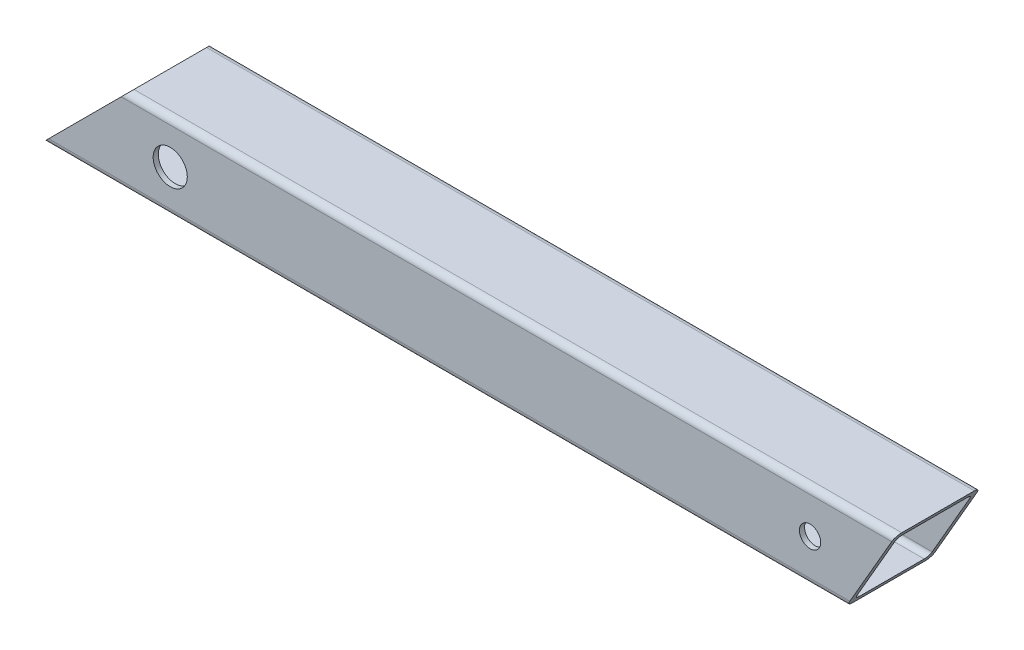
ISO-10303-21;
HEADER;
FILE_DESCRIPTION(('STEP AP214'),'2;1');
FILE_NAME('part.step','',(''),(''),'','','');
FILE_SCHEMA(('AUTOMOTIVE_DESIGN { 1 0 10303 214 1 1 1 1 }'));
ENDSEC;
DATA;
#1=APPLICATION_CONTEXT('core data for automotive mechanical design processes');
#2=APPLICATION_PROTOCOL_DEFINITION('international standard','automotive_design',2000,#1);
#3=PRODUCT_CONTEXT('',#1,'mechanical');
#4=PRODUCT('Part','Part','',(#3));
#5=PRODUCT_RELATED_PRODUCT_CATEGORY('part','',(#4));
#6=PRODUCT_DEFINITION_FORMATION('','',#4);
#7=PRODUCT_DEFINITION_CONTEXT('part definition',#1,'design');
#8=PRODUCT_DEFINITION('design','',#6,#7);
#9=PRODUCT_DEFINITION_SHAPE('','',#8);
#10=(LENGTH_UNIT() NAMED_UNIT(*) SI_UNIT(.MILLI.,.METRE.));
#11=(NAMED_UNIT(*) PLANE_ANGLE_UNIT() SI_UNIT($,.RADIAN.));
#12=(NAMED_UNIT(*) SI_UNIT($,.STERADIAN.) SOLID_ANGLE_UNIT());
#13=UNCERTAINTY_MEASURE_WITH_UNIT(LENGTH_MEASURE(1.E-05),#10,'distance_accuracy_value','');
#14=(GEOMETRIC_REPRESENTATION_CONTEXT(3) GLOBAL_UNCERTAINTY_ASSIGNED_CONTEXT((#13)) GLOBAL_UNIT_ASSIGNED_CONTEXT((#10,
#11,#12)) REPRESENTATION_CONTEXT('',''));
#15=CARTESIAN_POINT('',(0.,0.,0.));
#16=DIRECTION('',(0.,0.,1.));
#17=DIRECTION('',(1.,0.,0.));
#18=AXIS2_PLACEMENT_3D('',#15,#16,#17);
#19=CARTESIAN_POINT('',(1000.,38.,-38.0000000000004));
#20=DIRECTION('',(-1.,0.,0.));
#21=DIRECTION('',(0.,0.,1.));
#22=AXIS2_PLACEMENT_3D('',#19,#20,#21);
#23=CYLINDRICAL_SURFACE('',#22,5.99999999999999);
#24=DIRECTION('',(-1.,0.,0.));
#25=VECTOR('',#24,1.);
#26=CARTESIAN_POINT('',(1000.,38.,-44.0000000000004));
#27=LINE('',#26,#25);
#28=CARTESIAN_POINT('',(993.071796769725,38.,-44.0000000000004));
#29=VERTEX_POINT('',#28);
#30=CARTESIAN_POINT('',(87.9999999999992,38.,-44.));
#31=VERTEX_POINT('',#30);
#32=EDGE_CURVE('E12',#29,#31,#27,.T.);
#33=ORIENTED_EDGE('',*,*,#32,.F.);
#34=CARTESIAN_POINT('',(993.071796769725,38.,-38.0000000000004));
#35=DIRECTION('',(0.866025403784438,-0.500000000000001,0.));
#36=DIRECTION('',(-0.500000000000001,-0.866025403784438,0.));
#37=AXIS2_PLACEMENT_3D('',#34,#35,#36);
#38=ELLIPSE('',#37,6.9282032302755,5.99999999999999);
#39=CARTESIAN_POINT('',(996.535898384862,44.,-38.0000000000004));
#40=VERTEX_POINT('',#39);
#41=EDGE_CURVE('E287',#29,#40,#38,.T.);
#42=ORIENTED_EDGE('',*,*,#41,.T.);
#43=DIRECTION('',(-1.,0.,0.));
#44=VECTOR('',#43,1.);
#45=CARTESIAN_POINT('',(1000.,44.,-38.0000000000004));
#46=LINE('',#45,#44);
#47=CARTESIAN_POINT('',(93.9999999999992,44.,-38.));
#48=VERTEX_POINT('',#47);
#49=EDGE_CURVE('E213',#40,#48,#46,.T.);
#50=ORIENTED_EDGE('',*,*,#49,.T.);
#51=CARTESIAN_POINT('',(87.9999999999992,38.,-38.));
#52=DIRECTION('',(-0.707106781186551,0.707106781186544,0.));
#53=DIRECTION('',(-0.707106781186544,-0.707106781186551,0.));
#54=AXIS2_PLACEMENT_3D('',#51,#52,#53);
#55=ELLIPSE('',#54,8.48528137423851,5.99999999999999);
#56=EDGE_CURVE('E254',#48,#31,#55,.T.);
#57=ORIENTED_EDGE('',*,*,#56,.T.);
#58=EDGE_LOOP('',(#33,#42,#50,#57));
#59=FACE_BOUND('',#58,.T.);
#60=ADVANCED_FACE('F67',(#59),#23,.F.);
#61=CARTESIAN_POINT('',(1000.,38.,-44.0000000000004));
#62=DIRECTION('',(0.,0.,1.));
#63=DIRECTION('',(1.,0.,0.));
#64=AXIS2_PLACEMENT_3D('',#61,#62,#63);
#65=PLANE('',#64);
#66=CARTESIAN_POINT('',(900.,0.,-44.0000000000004));
#67=DIRECTION('',(0.,0.,1.));
#68=DIRECTION('',(1.,0.,0.));
#69=AXIS2_PLACEMENT_3D('',#66,#67,#68);
#70=CIRCLE('',#69,12.5);
#71=CARTESIAN_POINT('',(912.5,0.,-44.0000000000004));
#72=VERTEX_POINT('',#71);
#73=EDGE_CURVE('E324',#72,#72,#70,.T.);
#74=ORIENTED_EDGE('',*,*,#73,.F.);
#75=EDGE_LOOP('',(#74));
#76=FACE_BOUND('',#75,.T.);
#77=CARTESIAN_POINT('',(150.,0.,-44.0000000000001));
#78=DIRECTION('',(0.,0.,1.));
#79=DIRECTION('',(1.,0.,0.));
#80=AXIS2_PLACEMENT_3D('',#77,#78,#79);
#81=CIRCLE('',#80,20.);
#82=CARTESIAN_POINT('',(170.,0.,-44.0000000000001));
#83=VERTEX_POINT('',#82);
#84=EDGE_CURVE('E314',#83,#83,#81,.T.);
#85=ORIENTED_EDGE('',*,*,#84,.F.);
#86=EDGE_LOOP('',(#85));
#87=FACE_BOUND('',#86,.T.);
#88=DIRECTION('',(-1.,0.,0.));
#89=VECTOR('',#88,1.);
#90=CARTESIAN_POINT('',(1000.,-38.,-44.0000000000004));
#91=LINE('',#90,#89);
#92=CARTESIAN_POINT('',(949.193176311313,-38.,-44.0000000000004));
#93=VERTEX_POINT('',#92);
#94=CARTESIAN_POINT('',(12.,-38.,-44.));
#95=VERTEX_POINT('',#94);
#96=EDGE_CURVE('E76',#93,#95,#91,.T.);
#97=ORIENTED_EDGE('',*,*,#96,.F.);
#98=DIRECTION('',(0.500000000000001,0.866025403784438,0.));
#99=VECTOR('',#98,1.);
#100=CARTESIAN_POINT('',(994.803847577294,41.,-44.0000000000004));
#101=LINE('',#100,#99);
#102=EDGE_CURVE('E290',#93,#29,#101,.T.);
#103=ORIENTED_EDGE('',*,*,#102,.T.);
#104=ORIENTED_EDGE('',*,*,#32,.T.);
#105=DIRECTION('',(-0.707106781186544,-0.707106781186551,0.));
#106=VECTOR('',#105,1.);
#107=CARTESIAN_POINT('',(543.999999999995,494.000000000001,-44.0000000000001));
#108=LINE('',#107,#106);
#109=EDGE_CURVE('E257',#31,#95,#108,.T.);
#110=ORIENTED_EDGE('',*,*,#109,.T.);
#111=EDGE_LOOP('',(#97,#103,#104,#110));
#112=FACE_BOUND('',#111,.T.);
#113=ADVANCED_FACE('F357',(#76,#87,#112),#65,.T.);
#114=CARTESIAN_POINT('',(1000.,-38.,-38.0000000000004));
#115=DIRECTION('',(-1.,0.,0.));
#116=DIRECTION('',(0.,0.,1.));
#117=AXIS2_PLACEMENT_3D('',#114,#115,#116);
#118=CYLINDRICAL_SURFACE('',#117,5.99999999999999);
#119=DIRECTION('',(-1.,0.,0.));
#120=VECTOR('',#119,1.);
#121=CARTESIAN_POINT('',(1000.,-44.,-38.0000000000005));
#122=LINE('',#121,#120);
#123=CARTESIAN_POINT('',(945.729074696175,-44.,-38.0000000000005));
#124=VERTEX_POINT('',#123);
#125=CARTESIAN_POINT('',(5.9999999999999,-44.,-38.0000000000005));
#126=VERTEX_POINT('',#125);
#127=EDGE_CURVE('E223',#124,#126,#122,.T.);
#128=ORIENTED_EDGE('',*,*,#127,.F.);
#129=CARTESIAN_POINT('',(949.193176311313,-38.,-38.0000000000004));
#130=DIRECTION('',(0.866025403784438,-0.500000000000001,0.));
#131=DIRECTION('',(-0.500000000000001,-0.866025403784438,0.));
#132=AXIS2_PLACEMENT_3D('',#129,#130,#131);
#133=ELLIPSE('',#132,6.9282032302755,5.99999999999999);
#134=EDGE_CURVE('E293',#124,#93,#133,.T.);
#135=ORIENTED_EDGE('',*,*,#134,.T.);
#136=ORIENTED_EDGE('',*,*,#96,.T.);
#137=CARTESIAN_POINT('',(12.,-38.,-38.));
#138=DIRECTION('',(-0.707106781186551,0.707106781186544,0.));
#139=DIRECTION('',(-0.707106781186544,-0.707106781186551,0.));
#140=AXIS2_PLACEMENT_3D('',#137,#138,#139);
#141=ELLIPSE('',#140,8.48528137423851,5.99999999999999);
#142=EDGE_CURVE('E260',#95,#126,#141,.T.);
#143=ORIENTED_EDGE('',*,*,#142,.T.);
#144=EDGE_LOOP('',(#128,#135,#136,#143));
#145=FACE_BOUND('',#144,.T.);
#146=ADVANCED_FACE('F363',(#145),#118,.F.);
#147=CARTESIAN_POINT('',(1000.,-44.,37.9999999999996));
#148=DIRECTION('',(0.,1.,0.));
#149=DIRECTION('',(0.,0.,1.));
#150=AXIS2_PLACEMENT_3D('',#147,#148,#149);
#151=PLANE('',#150);
#152=DIRECTION('',(-1.,0.,0.));
#153=VECTOR('',#152,1.);
#154=CARTESIAN_POINT('',(1000.,-44.,37.9999999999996));
#155=LINE('',#154,#153);
#156=CARTESIAN_POINT('',(945.729074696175,-44.,37.9999999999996));
#157=VERTEX_POINT('',#156);
#158=CARTESIAN_POINT('',(6.00000000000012,-44.,38.));
#159=VERTEX_POINT('',#158);
#160=EDGE_CURVE('E221',#157,#159,#155,.T.);
#161=ORIENTED_EDGE('',*,*,#160,.F.);
#162=DIRECTION('',(0.,0.,-1.));
#163=VECTOR('',#162,1.);
#164=CARTESIAN_POINT('',(945.729074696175,-44.,37.9999999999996));
#165=LINE('',#164,#163);
#166=EDGE_CURVE('E296',#157,#124,#165,.T.);
#167=ORIENTED_EDGE('',*,*,#166,.T.);
#168=ORIENTED_EDGE('',*,*,#127,.T.);
#169=DIRECTION('',(0.,0.,1.));
#170=VECTOR('',#169,1.);
#171=CARTESIAN_POINT('',(5.99999999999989,-44.,37.9999999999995));
#172=LINE('',#171,#170);
#173=EDGE_CURVE('E263',#126,#159,#172,.T.);
#174=ORIENTED_EDGE('',*,*,#173,.T.);
#175=EDGE_LOOP('',(#161,#167,#168,#174));
#176=FACE_BOUND('',#175,.T.);
#177=ADVANCED_FACE('F414',(#176),#151,.T.);
#178=CARTESIAN_POINT('',(1000.,-38.,37.9999999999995));
#179=DIRECTION('',(-1.,0.,0.));
#180=DIRECTION('',(0.,0.,1.));
#181=AXIS2_PLACEMENT_3D('',#178,#179,#180);
#182=CYLINDRICAL_SURFACE('',#181,5.99999999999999);
#183=DIRECTION('',(-1.,0.,0.));
#184=VECTOR('',#183,1.);
#185=CARTESIAN_POINT('',(1000.,-38.,43.9999999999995));
#186=LINE('',#185,#184);
#187=CARTESIAN_POINT('',(949.193176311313,-38.,43.9999999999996));
#188=VERTEX_POINT('',#187);
#189=CARTESIAN_POINT('',(11.9999999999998,-38.0000000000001,44.));
#190=VERTEX_POINT('',#189);
#191=EDGE_CURVE('E219',#188,#190,#186,.T.);
#192=ORIENTED_EDGE('',*,*,#191,.F.);
#193=CARTESIAN_POINT('',(949.193176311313,-38.,37.9999999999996));
#194=DIRECTION('',(0.866025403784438,-0.500000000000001,0.));
#195=DIRECTION('',(-0.500000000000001,-0.866025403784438,0.));
#196=AXIS2_PLACEMENT_3D('',#193,#194,#195);
#197=ELLIPSE('',#196,6.9282032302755,5.99999999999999);
#198=EDGE_CURVE('E299',#188,#157,#197,.T.);
#199=ORIENTED_EDGE('',*,*,#198,.T.);
#200=ORIENTED_EDGE('',*,*,#160,.T.);
#201=CARTESIAN_POINT('',(12.,-38.,38.));
#202=DIRECTION('',(-0.707106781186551,0.707106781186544,0.));
#203=DIRECTION('',(-0.707106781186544,-0.707106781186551,0.));
#204=AXIS2_PLACEMENT_3D('',#201,#202,#203);
#205=ELLIPSE('',#204,8.48528137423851,5.99999999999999);
#206=EDGE_CURVE('E266',#159,#190,#205,.T.);
#207=ORIENTED_EDGE('',*,*,#206,.T.);
#208=EDGE_LOOP('',(#192,#199,#200,#207));
#209=FACE_BOUND('',#208,.T.);
#210=ADVANCED_FACE('F410',(#209),#182,.F.);
#211=CARTESIAN_POINT('',(1000.,38.,43.9999999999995));
#212=DIRECTION('',(0.,0.,-1.));
#213=DIRECTION('',(-1.,0.,0.));
#214=AXIS2_PLACEMENT_3D('',#211,#212,#213);
#215=PLANE('',#214);
#216=CARTESIAN_POINT('',(900.,0.,43.9999999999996));
#217=DIRECTION('',(0.,0.,-1.));
#218=DIRECTION('',(-1.,0.,0.));
#219=AXIS2_PLACEMENT_3D('',#216,#217,#218);
#220=CIRCLE('',#219,12.5);
#221=CARTESIAN_POINT('',(887.5,0.,43.9999999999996));
#222=VERTEX_POINT('',#221);
#223=EDGE_CURVE('E329',#222,#222,#220,.T.);
#224=ORIENTED_EDGE('',*,*,#223,.F.);
#225=EDGE_LOOP('',(#224));
#226=FACE_BOUND('',#225,.T.);
#227=CARTESIAN_POINT('',(150.,0.,43.9999999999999));
#228=DIRECTION('',(0.,0.,-1.));
#229=DIRECTION('',(-1.,0.,0.));
#230=AXIS2_PLACEMENT_3D('',#227,#228,#229);
#231=CIRCLE('',#230,20.);
#232=CARTESIAN_POINT('',(130.,0.,43.9999999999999));
#233=VERTEX_POINT('',#232);
#234=EDGE_CURVE('E317',#233,#233,#231,.T.);
#235=ORIENTED_EDGE('',*,*,#234,.F.);
#236=EDGE_LOOP('',(#235));
#237=FACE_BOUND('',#236,.T.);
#238=DIRECTION('',(-1.,0.,0.));
#239=VECTOR('',#238,1.);
#240=CARTESIAN_POINT('',(1000.,38.,43.9999999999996));
#241=LINE('',#240,#239);
#242=CARTESIAN_POINT('',(993.071796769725,38.,43.9999999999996));
#243=VERTEX_POINT('',#242);
#244=CARTESIAN_POINT('',(87.9999999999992,38.,44.));
#245=VERTEX_POINT('',#244);
#246=EDGE_CURVE('E217',#243,#245,#241,.T.);
#247=ORIENTED_EDGE('',*,*,#246,.F.);
#248=DIRECTION('',(-0.500000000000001,-0.866025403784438,0.));
#249=VECTOR('',#248,1.);
#250=CARTESIAN_POINT('',(994.803847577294,41.,43.9999999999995));
#251=LINE('',#250,#249);
#252=EDGE_CURVE('E302',#243,#188,#251,.T.);
#253=ORIENTED_EDGE('',*,*,#252,.T.);
#254=ORIENTED_EDGE('',*,*,#191,.T.);
#255=DIRECTION('',(0.707106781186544,0.707106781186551,0.));
#256=VECTOR('',#255,1.);
#257=CARTESIAN_POINT('',(543.999999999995,494.000000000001,43.9999999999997));
#258=LINE('',#257,#256);
#259=EDGE_CURVE('E269',#190,#245,#258,.T.);
#260=ORIENTED_EDGE('',*,*,#259,.T.);
#261=EDGE_LOOP('',(#247,#253,#254,#260));
#262=FACE_BOUND('',#261,.T.);
#263=ADVANCED_FACE('F406',(#226,#237,#262),#215,.T.);
#264=CARTESIAN_POINT('',(1000.,38.,37.9999999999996));
#265=DIRECTION('',(-1.,0.,0.));
#266=DIRECTION('',(0.,0.,1.));
#267=AXIS2_PLACEMENT_3D('',#264,#265,#266);
#268=CYLINDRICAL_SURFACE('',#267,5.99999999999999);
#269=DIRECTION('',(-1.,0.,0.));
#270=VECTOR('',#269,1.);
#271=CARTESIAN_POINT('',(1000.,44.,37.9999999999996));
#272=LINE('',#271,#270);
#273=CARTESIAN_POINT('',(996.535898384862,44.,37.9999999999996));
#274=VERTEX_POINT('',#273);
#275=CARTESIAN_POINT('',(93.9999999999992,44.,38.));
#276=VERTEX_POINT('',#275);
#277=EDGE_CURVE('E215',#274,#276,#272,.T.);
#278=ORIENTED_EDGE('',*,*,#277,.F.);
#279=CARTESIAN_POINT('',(993.071796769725,38.,37.9999999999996));
#280=DIRECTION('',(0.866025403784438,-0.500000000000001,0.));
#281=DIRECTION('',(-0.500000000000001,-0.866025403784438,0.));
#282=AXIS2_PLACEMENT_3D('',#279,#280,#281);
#283=ELLIPSE('',#282,6.9282032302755,5.99999999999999);
#284=EDGE_CURVE('E305',#274,#243,#283,.T.);
#285=ORIENTED_EDGE('',*,*,#284,.T.);
#286=ORIENTED_EDGE('',*,*,#246,.T.);
#287=CARTESIAN_POINT('',(87.9999999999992,38.,38.));
#288=DIRECTION('',(-0.707106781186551,0.707106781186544,0.));
#289=DIRECTION('',(-0.707106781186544,-0.707106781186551,0.));
#290=AXIS2_PLACEMENT_3D('',#287,#288,#289);
#291=ELLIPSE('',#290,8.48528137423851,5.99999999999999);
#292=EDGE_CURVE('E272',#245,#276,#291,.T.);
#293=ORIENTED_EDGE('',*,*,#292,.T.);
#294=EDGE_LOOP('',(#278,#285,#286,#293));
#295=FACE_BOUND('',#294,.T.);
#296=ADVANCED_FACE('F403',(#295),#268,.F.);
#297=CARTESIAN_POINT('',(1000.,42.5,-42.5000000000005));
#298=DIRECTION('',(-1.,0.,0.));
#299=DIRECTION('',(0.,0.,1.));
#300=AXIS2_PLACEMENT_3D('',#297,#298,#299);
#301=CYLINDRICAL_SURFACE('',#300,7.5);
#302=CARTESIAN_POINT('',(995.669872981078,42.5,-42.5000000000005));
#303=DIRECTION('',(0.866025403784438,-0.500000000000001,0.));
#304=DIRECTION('',(-0.500000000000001,-0.866025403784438,0.));
#305=AXIS2_PLACEMENT_3D('',#302,#303,#304);
#306=ELLIPSE('',#305,8.66025403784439,7.5);
#307=CARTESIAN_POINT('',(995.669872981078,42.5,-50.0000000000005));
#308=VERTEX_POINT('',#307);
#309=CARTESIAN_POINT('',(1000.,50.,-42.5000000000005));
#310=VERTEX_POINT('',#309);
#311=EDGE_CURVE('E201',#308,#310,#306,.T.);
#312=ORIENTED_EDGE('',*,*,#311,.F.);
#313=DIRECTION('',(-1.,0.,0.));
#314=VECTOR('',#313,1.);
#315=CARTESIAN_POINT('',(1000.,42.5,-50.0000000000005));
#316=LINE('',#315,#314);
#317=CARTESIAN_POINT('',(92.4999999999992,42.5000000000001,-50.0000000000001));
#318=VERTEX_POINT('',#317);
#319=EDGE_CURVE('E202',#308,#318,#316,.T.);
#320=ORIENTED_EDGE('',*,*,#319,.T.);
#321=CARTESIAN_POINT('',(92.4999999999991,42.5,-42.5));
#322=DIRECTION('',(-0.707106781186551,0.707106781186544,0.));
#323=DIRECTION('',(-0.707106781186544,-0.707106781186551,0.));
#324=AXIS2_PLACEMENT_3D('',#321,#322,#323);
#325=ELLIPSE('',#324,10.6066017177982,7.5);
#326=CARTESIAN_POINT('',(99.999999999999,50.,-42.5000000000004));
#327=VERTEX_POINT('',#326);
#328=EDGE_CURVE('E243',#327,#318,#325,.T.);
#329=ORIENTED_EDGE('',*,*,#328,.F.);
#330=DIRECTION('',(-1.,0.,0.));
#331=VECTOR('',#330,1.);
#332=CARTESIAN_POINT('',(1000.,50.,-42.5000000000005));
#333=LINE('',#332,#331);
#334=EDGE_CURVE('E71',#310,#327,#333,.T.);
#335=ORIENTED_EDGE('',*,*,#334,.F.);
#336=EDGE_LOOP('',(#312,#320,#329,#335));
#337=FACE_BOUND('',#336,.T.);
#338=ADVANCED_FACE('F69',(#337),#301,.T.);
#339=CARTESIAN_POINT('',(1000.,42.5,42.4999999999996));
#340=DIRECTION('',(-1.,0.,0.));
#341=DIRECTION('',(0.,0.,1.));
#342=AXIS2_PLACEMENT_3D('',#339,#340,#341);
#343=CYLINDRICAL_SURFACE('',#342,7.5);
#344=CARTESIAN_POINT('',(995.669872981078,42.5,42.4999999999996));
#345=DIRECTION('',(0.866025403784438,-0.500000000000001,0.));
#346=DIRECTION('',(-0.500000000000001,-0.866025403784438,0.));
#347=AXIS2_PLACEMENT_3D('',#344,#345,#346);
#348=ELLIPSE('',#347,8.66025403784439,7.5);
#349=CARTESIAN_POINT('',(1000.,50.,42.4999999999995));
#350=VERTEX_POINT('',#349);
#351=CARTESIAN_POINT('',(995.669872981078,42.5,49.9999999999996));
#352=VERTEX_POINT('',#351);
#353=EDGE_CURVE('E194',#350,#352,#348,.T.);
#354=ORIENTED_EDGE('',*,*,#353,.F.);
#355=DIRECTION('',(-1.,0.,0.));
#356=VECTOR('',#355,1.);
#357=CARTESIAN_POINT('',(1000.,50.,42.4999999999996));
#358=LINE('',#357,#356);
#359=CARTESIAN_POINT('',(99.9999999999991,50.,42.5));
#360=VERTEX_POINT('',#359);
#361=EDGE_CURVE('E182',#350,#360,#358,.T.);
#362=ORIENTED_EDGE('',*,*,#361,.T.);
#363=CARTESIAN_POINT('',(92.4999999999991,42.5,42.5));
#364=DIRECTION('',(-0.707106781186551,0.707106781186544,0.));
#365=DIRECTION('',(-0.707106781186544,-0.707106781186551,0.));
#366=AXIS2_PLACEMENT_3D('',#363,#364,#365);
#367=ELLIPSE('',#366,10.6066017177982,7.5);
#368=CARTESIAN_POINT('',(92.4999999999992,42.5000000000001,50.));
#369=VERTEX_POINT('',#368);
#370=EDGE_CURVE('E208',#369,#360,#367,.T.);
#371=ORIENTED_EDGE('',*,*,#370,.F.);
#372=DIRECTION('',(-1.,0.,0.));
#373=VECTOR('',#372,1.);
#374=CARTESIAN_POINT('',(1000.,42.5,49.9999999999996));
#375=LINE('',#374,#373);
#376=EDGE_CURVE('E192',#352,#369,#375,.T.);
#377=ORIENTED_EDGE('',*,*,#376,.F.);
#378=EDGE_LOOP('',(#354,#362,#371,#377));
#379=FACE_BOUND('',#378,.T.);
#380=ADVANCED_FACE('F195',(#379),#343,.T.);
#381=CARTESIAN_POINT('',(1000.,42.5,49.9999999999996));
#382=DIRECTION('',(0.,0.,-1.));
#383=DIRECTION('',(-1.,0.,0.));
#384=AXIS2_PLACEMENT_3D('',#381,#382,#383);
#385=PLANE('',#384);
#386=CARTESIAN_POINT('',(900.,0.,50.));
#387=DIRECTION('',(0.,0.,1.));
#388=DIRECTION('',(1.,0.,0.));
#389=AXIS2_PLACEMENT_3D('',#386,#387,#388);
#390=CIRCLE('',#389,12.5);
#391=CARTESIAN_POINT('',(912.5,0.,50.));
#392=VERTEX_POINT('',#391);
#393=EDGE_CURVE('E333',#392,#392,#390,.T.);
#394=ORIENTED_EDGE('',*,*,#393,.F.);
#395=EDGE_LOOP('',(#394));
#396=FACE_BOUND('',#395,.T.);
#397=CARTESIAN_POINT('',(150.,0.,50.));
#398=DIRECTION('',(0.,0.,1.));
#399=DIRECTION('',(1.,0.,0.));
#400=AXIS2_PLACEMENT_3D('',#397,#398,#399);
#401=CIRCLE('',#400,20.);
#402=CARTESIAN_POINT('',(170.,0.,50.));
#403=VERTEX_POINT('',#402);
#404=EDGE_CURVE('E321',#403,#403,#401,.T.);
#405=ORIENTED_EDGE('',*,*,#404,.F.);
#406=EDGE_LOOP('',(#405));
#407=FACE_BOUND('',#406,.T.);
#408=DIRECTION('',(-0.500000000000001,-0.866025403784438,0.));
#409=VECTOR('',#408,1.);
#410=CARTESIAN_POINT('',(996.752404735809,44.375,49.9999999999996));
#411=LINE('',#410,#409);
#412=CARTESIAN_POINT('',(946.59510009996,-42.5,49.9999999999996));
#413=VERTEX_POINT('',#412);
#414=EDGE_CURVE('E84',#352,#413,#411,.T.);
#415=ORIENTED_EDGE('',*,*,#414,.F.);
#416=ORIENTED_EDGE('',*,*,#376,.T.);
#417=DIRECTION('',(0.707106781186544,0.707106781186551,0.));
#418=VECTOR('',#417,1.);
#419=CARTESIAN_POINT('',(546.249999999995,496.250000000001,49.9999999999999));
#420=LINE('',#419,#418);
#421=CARTESIAN_POINT('',(7.49999999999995,-42.5,50.));
#422=VERTEX_POINT('',#421);
#423=EDGE_CURVE('E236',#422,#369,#420,.T.);
#424=ORIENTED_EDGE('',*,*,#423,.F.);
#425=DIRECTION('',(-1.,0.,0.));
#426=VECTOR('',#425,1.);
#427=CARTESIAN_POINT('',(1000.,-42.5,49.9999999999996));
#428=LINE('',#427,#426);
#429=EDGE_CURVE('E231',#413,#422,#428,.T.);
#430=ORIENTED_EDGE('',*,*,#429,.F.);
#431=EDGE_LOOP('',(#415,#416,#424,#430));
#432=FACE_BOUND('',#431,.T.);
#433=ADVANCED_FACE('F235',(#396,#407,#432),#385,.F.);
#434=CARTESIAN_POINT('',(1000.,-42.5,42.4999999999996));
#435=DIRECTION('',(-1.,0.,0.));
#436=DIRECTION('',(0.,0.,1.));
#437=AXIS2_PLACEMENT_3D('',#434,#435,#436);
#438=CYLINDRICAL_SURFACE('',#437,7.5);
#439=CARTESIAN_POINT('',(946.59510009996,-42.5,42.4999999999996));
#440=DIRECTION('',(0.866025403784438,-0.500000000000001,0.));
#441=DIRECTION('',(-0.500000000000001,-0.866025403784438,0.));
#442=AXIS2_PLACEMENT_3D('',#439,#440,#441);
#443=ELLIPSE('',#442,8.66025403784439,7.5);
#444=CARTESIAN_POINT('',(942.264973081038,-50.,42.4999999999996));
#445=VERTEX_POINT('',#444);
#446=EDGE_CURVE('E92',#413,#445,#443,.T.);
#447=ORIENTED_EDGE('',*,*,#446,.F.);
#448=ORIENTED_EDGE('',*,*,#429,.T.);
#449=CARTESIAN_POINT('',(7.49999999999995,-42.5,42.5));
#450=DIRECTION('',(-0.707106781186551,0.707106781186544,0.));
#451=DIRECTION('',(-0.707106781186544,-0.707106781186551,0.));
#452=AXIS2_PLACEMENT_3D('',#449,#450,#451);
#453=ELLIPSE('',#452,10.6066017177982,7.5);
#454=CARTESIAN_POINT('',(0.,-50.,42.5));
#455=VERTEX_POINT('',#454);
#456=EDGE_CURVE('E242',#455,#422,#453,.T.);
#457=ORIENTED_EDGE('',*,*,#456,.F.);
#458=DIRECTION('',(-1.,0.,0.));
#459=VECTOR('',#458,1.);
#460=CARTESIAN_POINT('',(1000.,-50.,42.4999999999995));
#461=LINE('',#460,#459);
#462=EDGE_CURVE('E229',#445,#455,#461,.T.);
#463=ORIENTED_EDGE('',*,*,#462,.F.);
#464=EDGE_LOOP('',(#447,#448,#457,#463));
#465=FACE_BOUND('',#464,.T.);
#466=ADVANCED_FACE('F375',(#465),#438,.T.);
#467=CARTESIAN_POINT('',(1000.,-42.5,-42.5000000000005));
#468=DIRECTION('',(-1.,0.,0.));
#469=DIRECTION('',(0.,0.,1.));
#470=AXIS2_PLACEMENT_3D('',#467,#468,#469);
#471=CYLINDRICAL_SURFACE('',#470,7.5);
#472=CARTESIAN_POINT('',(946.59510009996,-42.5,-42.5000000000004));
#473=DIRECTION('',(0.866025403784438,-0.500000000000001,0.));
#474=DIRECTION('',(-0.500000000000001,-0.866025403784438,0.));
#475=AXIS2_PLACEMENT_3D('',#472,#473,#474);
#476=ELLIPSE('',#475,8.66025403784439,7.5);
#477=CARTESIAN_POINT('',(942.264973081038,-50.,-42.5000000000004));
#478=VERTEX_POINT('',#477);
#479=CARTESIAN_POINT('',(946.59510009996,-42.5,-50.0000000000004));
#480=VERTEX_POINT('',#479);
#481=EDGE_CURVE('E282',#478,#480,#476,.T.);
#482=ORIENTED_EDGE('',*,*,#481,.F.);
#483=DIRECTION('',(-1.,0.,0.));
#484=VECTOR('',#483,1.);
#485=CARTESIAN_POINT('',(1000.,-50.,-42.5000000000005));
#486=LINE('',#485,#484);
#487=CARTESIAN_POINT('',(0.,-50.,-42.5));
#488=VERTEX_POINT('',#487);
#489=EDGE_CURVE('E227',#478,#488,#486,.T.);
#490=ORIENTED_EDGE('',*,*,#489,.T.);
#491=CARTESIAN_POINT('',(7.49999999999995,-42.5,-42.5));
#492=DIRECTION('',(-0.707106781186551,0.707106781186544,0.));
#493=DIRECTION('',(-0.707106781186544,-0.707106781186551,0.));
#494=AXIS2_PLACEMENT_3D('',#491,#492,#493);
#495=ELLIPSE('',#494,10.6066017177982,7.5);
#496=CARTESIAN_POINT('',(7.49999999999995,-42.5,-50.));
#497=VERTEX_POINT('',#496);
#498=EDGE_CURVE('E248',#497,#488,#495,.T.);
#499=ORIENTED_EDGE('',*,*,#498,.F.);
#500=DIRECTION('',(-1.,0.,0.));
#501=VECTOR('',#500,1.);
#502=CARTESIAN_POINT('',(1000.,-42.5,-50.0000000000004));
#503=LINE('',#502,#501);
#504=EDGE_CURVE('E205',#480,#497,#503,.T.);
#505=ORIENTED_EDGE('',*,*,#504,.F.);
#506=EDGE_LOOP('',(#482,#490,#499,#505));
#507=FACE_BOUND('',#506,.T.);
#508=ADVANCED_FACE('F372',(#507),#471,.T.);
#509=CARTESIAN_POINT('',(1000.,42.5,-50.0000000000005));
#510=DIRECTION('',(0.,0.,1.));
#511=DIRECTION('',(1.,0.,0.));
#512=AXIS2_PLACEMENT_3D('',#509,#510,#511);
#513=PLANE('',#512);
#514=CARTESIAN_POINT('',(900.,0.,-50.0000000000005));
#515=DIRECTION('',(0.,0.,1.));
#516=DIRECTION('',(1.,0.,0.));
#517=AXIS2_PLACEMENT_3D('',#514,#515,#516);
#518=CIRCLE('',#517,12.5);
#519=CARTESIAN_POINT('',(912.5,0.,-50.0000000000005));
#520=VERTEX_POINT('',#519);
#521=EDGE_CURVE('E332',#520,#520,#518,.T.);
#522=ORIENTED_EDGE('',*,*,#521,.T.);
#523=EDGE_LOOP('',(#522));
#524=FACE_BOUND('',#523,.T.);
#525=CARTESIAN_POINT('',(150.,0.,-50.0000000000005));
#526=DIRECTION('',(0.,0.,1.));
#527=DIRECTION('',(1.,0.,0.));
#528=AXIS2_PLACEMENT_3D('',#525,#526,#527);
#529=CIRCLE('',#528,20.);
#530=CARTESIAN_POINT('',(170.,0.,-50.0000000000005));
#531=VERTEX_POINT('',#530);
#532=EDGE_CURVE('E320',#531,#531,#529,.T.);
#533=ORIENTED_EDGE('',*,*,#532,.T.);
#534=EDGE_LOOP('',(#533));
#535=FACE_BOUND('',#534,.T.);
#536=DIRECTION('',(0.500000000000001,0.866025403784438,0.));
#537=VECTOR('',#536,1.);
#538=CARTESIAN_POINT('',(996.752404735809,44.375,-50.0000000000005));
#539=LINE('',#538,#537);
#540=EDGE_CURVE('E285',#480,#308,#539,.T.);
#541=ORIENTED_EDGE('',*,*,#540,.F.);
#542=ORIENTED_EDGE('',*,*,#504,.T.);
#543=DIRECTION('',(-0.707106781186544,-0.707106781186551,0.));
#544=VECTOR('',#543,1.);
#545=CARTESIAN_POINT('',(546.249999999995,496.250000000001,-50.0000000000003));
#546=LINE('',#545,#544);
#547=EDGE_CURVE('E251',#318,#497,#546,.T.);
#548=ORIENTED_EDGE('',*,*,#547,.F.);
#549=ORIENTED_EDGE('',*,*,#319,.F.);
#550=EDGE_LOOP('',(#541,#542,#548,#549));
#551=FACE_BOUND('',#550,.T.);
#552=ADVANCED_FACE('F339',(#524,#535,#551),#513,.F.);
#553=CARTESIAN_POINT('',(1000.,44.,37.9999999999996));
#554=DIRECTION('',(0.,-1.,0.));
#555=DIRECTION('',(0.,0.,-1.));
#556=AXIS2_PLACEMENT_3D('',#553,#554,#555);
#557=PLANE('',#556);
#558=ORIENTED_EDGE('',*,*,#49,.F.);
#559=DIRECTION('',(0.,0.,1.));
#560=VECTOR('',#559,1.);
#561=CARTESIAN_POINT('',(996.535898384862,44.,37.9999999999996));
#562=LINE('',#561,#560);
#563=EDGE_CURVE('E308',#40,#274,#562,.T.);
#564=ORIENTED_EDGE('',*,*,#563,.T.);
#565=ORIENTED_EDGE('',*,*,#277,.T.);
#566=DIRECTION('',(0.,0.,-1.));
#567=VECTOR('',#566,1.);
#568=CARTESIAN_POINT('',(93.9999999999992,44.,37.9999999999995));
#569=LINE('',#568,#567);
#570=EDGE_CURVE('E275',#276,#48,#569,.T.);
#571=ORIENTED_EDGE('',*,*,#570,.T.);
#572=EDGE_LOOP('',(#558,#564,#565,#571));
#573=FACE_BOUND('',#572,.T.);
#574=ADVANCED_FACE('F371',(#573),#557,.T.);
#575=CARTESIAN_POINT('',(1000.,-50.,42.4999999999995));
#576=DIRECTION('',(0.,1.,0.));
#577=DIRECTION('',(0.,0.,1.));
#578=AXIS2_PLACEMENT_3D('',#575,#576,#577);
#579=PLANE('',#578);
#580=DIRECTION('',(0.,0.,-1.));
#581=VECTOR('',#580,1.);
#582=CARTESIAN_POINT('',(942.264973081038,-50.,1309.93811729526));
#583=LINE('',#582,#581);
#584=EDGE_CURVE('E311',#445,#478,#583,.T.);
#585=ORIENTED_EDGE('',*,*,#584,.F.);
#586=ORIENTED_EDGE('',*,*,#462,.T.);
#587=DIRECTION('',(0.,0.,-1.));
#588=VECTOR('',#587,1.);
#589=CARTESIAN_POINT('',(0.,-50.,42.5));
#590=LINE('',#589,#588);
#591=EDGE_CURVE('E203',#455,#488,#590,.T.);
#592=ORIENTED_EDGE('',*,*,#591,.T.);
#593=ORIENTED_EDGE('',*,*,#489,.F.);
#594=EDGE_LOOP('',(#585,#586,#592,#593));
#595=FACE_BOUND('',#594,.T.);
#596=ADVANCED_FACE('F377',(#595),#579,.F.);
#597=CARTESIAN_POINT('',(1000.,50.,42.4999999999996));
#598=DIRECTION('',(0.,-1.,0.));
#599=DIRECTION('',(0.,0.,-1.));
#600=AXIS2_PLACEMENT_3D('',#597,#598,#599);
#601=PLANE('',#600);
#602=DIRECTION('',(0.,0.,-1.));
#603=VECTOR('',#602,1.);
#604=CARTESIAN_POINT('',(99.999999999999,50.,1317.43811729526));
#605=LINE('',#604,#603);
#606=EDGE_CURVE('E189',#360,#327,#605,.T.);
#607=ORIENTED_EDGE('',*,*,#606,.F.);
#608=ORIENTED_EDGE('',*,*,#361,.F.);
#609=DIRECTION('',(0.,0.,1.));
#610=VECTOR('',#609,1.);
#611=CARTESIAN_POINT('',(1000.,50.,42.4999999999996));
#612=LINE('',#611,#610);
#613=EDGE_CURVE('E187',#310,#350,#612,.T.);
#614=ORIENTED_EDGE('',*,*,#613,.F.);
#615=ORIENTED_EDGE('',*,*,#334,.T.);
#616=EDGE_LOOP('',(#607,#608,#614,#615));
#617=FACE_BOUND('',#616,.T.);
#618=ADVANCED_FACE('F184',(#617),#601,.F.);
#619=CARTESIAN_POINT('',(0.,-50.,1317.43811729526));
#620=DIRECTION('',(-0.707106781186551,0.707106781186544,0.));
#621=DIRECTION('',(-0.707106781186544,-0.707106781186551,0.));
#622=AXIS2_PLACEMENT_3D('',#619,#620,#621);
#623=PLANE('',#622);
#624=ORIENTED_EDGE('',*,*,#56,.F.);
#625=ORIENTED_EDGE('',*,*,#570,.F.);
#626=ORIENTED_EDGE('',*,*,#292,.F.);
#627=ORIENTED_EDGE('',*,*,#259,.F.);
#628=ORIENTED_EDGE('',*,*,#206,.F.);
#629=ORIENTED_EDGE('',*,*,#173,.F.);
#630=ORIENTED_EDGE('',*,*,#142,.F.);
#631=ORIENTED_EDGE('',*,*,#109,.F.);
#632=EDGE_LOOP('',(#624,#625,#626,#627,#628,#629,#630,#631));
#633=FACE_BOUND('',#632,.T.);
#634=ORIENTED_EDGE('',*,*,#423,.T.);
#635=ORIENTED_EDGE('',*,*,#370,.T.);
#636=ORIENTED_EDGE('',*,*,#606,.T.);
#637=ORIENTED_EDGE('',*,*,#328,.T.);
#638=ORIENTED_EDGE('',*,*,#547,.T.);
#639=ORIENTED_EDGE('',*,*,#498,.T.);
#640=ORIENTED_EDGE('',*,*,#591,.F.);
#641=ORIENTED_EDGE('',*,*,#456,.T.);
#642=EDGE_LOOP('',(#634,#635,#636,#637,#638,#639,#640,#641));
#643=FACE_BOUND('',#642,.T.);
#644=ADVANCED_FACE('F239',(#633,#643),#623,.T.);
#645=CARTESIAN_POINT('',(1000.,50.,1309.93811729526));
#646=DIRECTION('',(0.866025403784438,-0.500000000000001,0.));
#647=DIRECTION('',(0.500000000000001,0.866025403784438,0.));
#648=AXIS2_PLACEMENT_3D('',#645,#646,#647);
#649=PLANE('',#648);
#650=ORIENTED_EDGE('',*,*,#41,.F.);
#651=ORIENTED_EDGE('',*,*,#102,.F.);
#652=ORIENTED_EDGE('',*,*,#134,.F.);
#653=ORIENTED_EDGE('',*,*,#166,.F.);
#654=ORIENTED_EDGE('',*,*,#198,.F.);
#655=ORIENTED_EDGE('',*,*,#252,.F.);
#656=ORIENTED_EDGE('',*,*,#284,.F.);
#657=ORIENTED_EDGE('',*,*,#563,.F.);
#658=EDGE_LOOP('',(#650,#651,#652,#653,#654,#655,#656,#657));
#659=FACE_BOUND('',#658,.T.);
#660=ORIENTED_EDGE('',*,*,#613,.T.);
#661=ORIENTED_EDGE('',*,*,#353,.T.);
#662=ORIENTED_EDGE('',*,*,#414,.T.);
#663=ORIENTED_EDGE('',*,*,#446,.T.);
#664=ORIENTED_EDGE('',*,*,#584,.T.);
#665=ORIENTED_EDGE('',*,*,#481,.T.);
#666=ORIENTED_EDGE('',*,*,#540,.T.);
#667=ORIENTED_EDGE('',*,*,#311,.T.);
#668=EDGE_LOOP('',(#660,#661,#662,#663,#664,#665,#666,#667));
#669=FACE_BOUND('',#668,.T.);
#670=ADVANCED_FACE('F199',(#659,#669),#649,.T.);
#671=CARTESIAN_POINT('',(150.,0.,-50.0000000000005));
#672=DIRECTION('',(0.,0.,1.));
#673=DIRECTION('',(1.,0.,0.));
#674=AXIS2_PLACEMENT_3D('',#671,#672,#673);
#675=CYLINDRICAL_SURFACE('',#674,20.);
#676=ORIENTED_EDGE('',*,*,#84,.T.);
#677=EDGE_LOOP('',(#676));
#678=FACE_BOUND('',#677,.T.);
#679=ORIENTED_EDGE('',*,*,#532,.F.);
#680=EDGE_LOOP('',(#679));
#681=FACE_BOUND('',#680,.T.);
#682=ADVANCED_FACE('F353',(#678,#681),#675,.F.);
#683=ORIENTED_EDGE('',*,*,#234,.T.);
#684=EDGE_LOOP('',(#683));
#685=FACE_BOUND('',#684,.T.);
#686=ORIENTED_EDGE('',*,*,#404,.T.);
#687=EDGE_LOOP('',(#686));
#688=FACE_BOUND('',#687,.T.);
#689=ADVANCED_FACE('F345',(#685,#688),#675,.F.);
#690=CARTESIAN_POINT('',(900.,0.,-50.0000000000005));
#691=DIRECTION('',(0.,0.,1.));
#692=DIRECTION('',(1.,0.,0.));
#693=AXIS2_PLACEMENT_3D('',#690,#691,#692);
#694=CYLINDRICAL_SURFACE('',#693,12.5);
#695=ORIENTED_EDGE('',*,*,#73,.T.);
#696=EDGE_LOOP('',(#695));
#697=FACE_BOUND('',#696,.T.);
#698=ORIENTED_EDGE('',*,*,#521,.F.);
#699=EDGE_LOOP('',(#698));
#700=FACE_BOUND('',#699,.T.);
#701=ADVANCED_FACE('F342',(#697,#700),#694,.F.);
#702=ORIENTED_EDGE('',*,*,#223,.T.);
#703=EDGE_LOOP('',(#702));
#704=FACE_BOUND('',#703,.T.);
#705=ORIENTED_EDGE('',*,*,#393,.T.);
#706=EDGE_LOOP('',(#705));
#707=FACE_BOUND('',#706,.T.);
#708=ADVANCED_FACE('F344',(#704,#707),#694,.F.);
#709=CLOSED_SHELL('',(#60,#113,#146,#177,#210,#263,#296,#338,#380,#433,#466,#508,#552,#574,#596,
#618,#644,#670,#682,#689,#701,#708));
#710=MANIFOLD_SOLID_BREP('B2',#709);
#711=ADVANCED_BREP_SHAPE_REPRESENTATION('',(#18,#710),#14);
#712=SHAPE_DEFINITION_REPRESENTATION(#9,#711);
ENDSEC;
END-ISO-10303-21;
